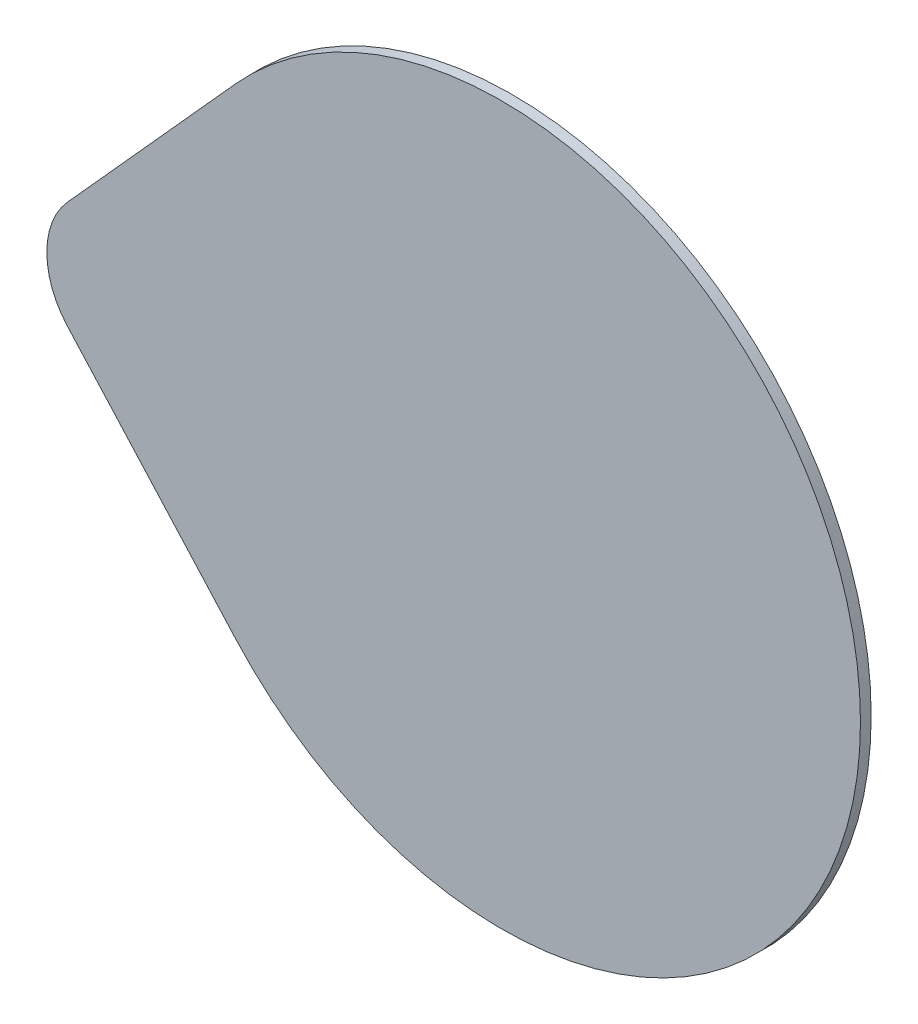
from build123d import *

# Parameters (mm, degrees)
BASE_EXTRUSION_DEPTH = 1


with BuildPart() as part:
    # Esquisse1 → Base-Extrusion (new body)
    with BuildSketch(Plane.XY):
        with BuildLine():
            Line((-40.571428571, 5.020874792), (-24.885714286, 22.426574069))
            ThreePointArc((-24.885714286, 22.426574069), (33.5, 0), (-24.885714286, -22.426574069))
            Line((-24.885714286, -22.426574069), (-40.571428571, -5.020874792))
            ThreePointArc((-40.571428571, -5.020874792), (-42.5, 0), (-40.571428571, 5.020874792))
        make_face()
    extrude(amount=BASE_EXTRUSION_DEPTH)


solid = part.part
